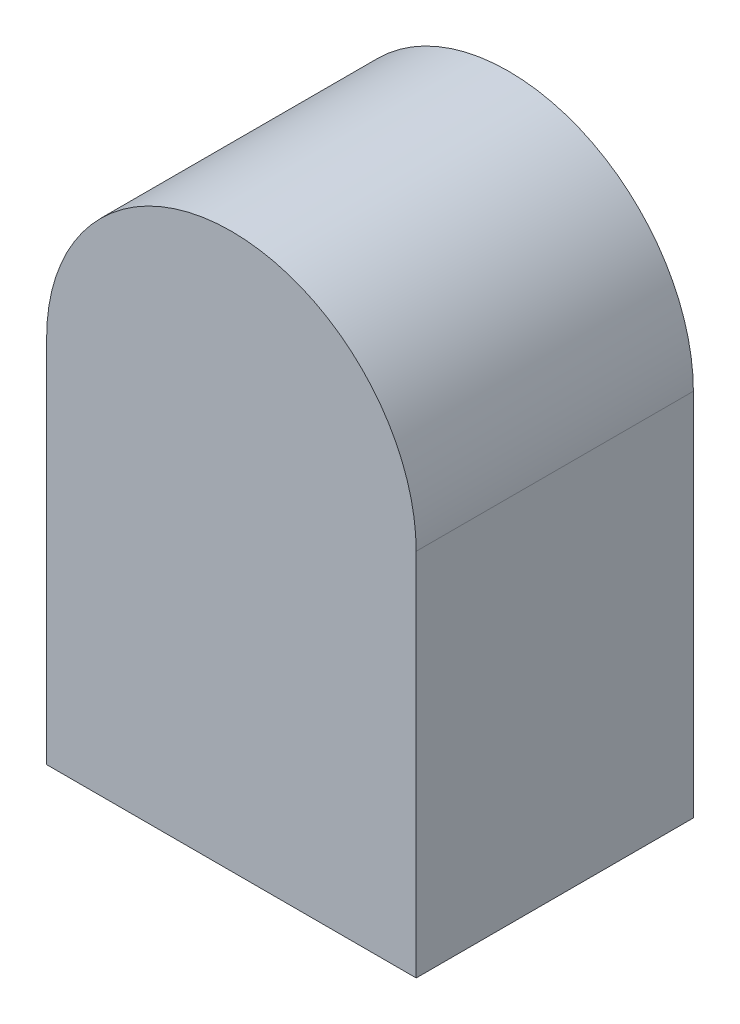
ISO-10303-21;
HEADER;
FILE_DESCRIPTION(('STEP AP214'),'2;1');
FILE_NAME('part.step','',(''),(''),'','','');
FILE_SCHEMA(('AUTOMOTIVE_DESIGN { 1 0 10303 214 1 1 1 1 }'));
ENDSEC;
DATA;
#1=APPLICATION_CONTEXT('core data for automotive mechanical design processes');
#2=APPLICATION_PROTOCOL_DEFINITION('international standard','automotive_design',2000,#1);
#3=PRODUCT_CONTEXT('',#1,'mechanical');
#4=PRODUCT('Part','Part','',(#3));
#5=PRODUCT_RELATED_PRODUCT_CATEGORY('part','',(#4));
#6=PRODUCT_DEFINITION_FORMATION('','',#4);
#7=PRODUCT_DEFINITION_CONTEXT('part definition',#1,'design');
#8=PRODUCT_DEFINITION('design','',#6,#7);
#9=PRODUCT_DEFINITION_SHAPE('','',#8);
#10=(LENGTH_UNIT() NAMED_UNIT(*) SI_UNIT(.MILLI.,.METRE.));
#11=(NAMED_UNIT(*) PLANE_ANGLE_UNIT() SI_UNIT($,.RADIAN.));
#12=(NAMED_UNIT(*) SI_UNIT($,.STERADIAN.) SOLID_ANGLE_UNIT());
#13=UNCERTAINTY_MEASURE_WITH_UNIT(LENGTH_MEASURE(1.E-05),#10,'distance_accuracy_value','');
#14=(GEOMETRIC_REPRESENTATION_CONTEXT(3) GLOBAL_UNCERTAINTY_ASSIGNED_CONTEXT((#13)) GLOBAL_UNIT_ASSIGNED_CONTEXT((#10,
#11,#12)) REPRESENTATION_CONTEXT('',''));
#15=CARTESIAN_POINT('',(0.,0.,0.));
#16=DIRECTION('',(0.,0.,1.));
#17=DIRECTION('',(1.,0.,0.));
#18=AXIS2_PLACEMENT_3D('',#15,#16,#17);
#19=CARTESIAN_POINT('',(25.4,0.,-38.1));
#20=DIRECTION('',(0.,-1.,0.));
#21=DIRECTION('',(1.,0.,0.));
#22=AXIS2_PLACEMENT_3D('',#19,#20,#21);
#23=PLANE('',#22);
#24=DIRECTION('',(1.,0.,0.));
#25=VECTOR('',#24,1.);
#26=CARTESIAN_POINT('',(25.4,0.,0.));
#27=LINE('',#26,#25);
#28=CARTESIAN_POINT('',(-25.4,0.,0.));
#29=VERTEX_POINT('',#28);
#30=CARTESIAN_POINT('',(25.4,0.,0.));
#31=VERTEX_POINT('',#30);
#32=EDGE_CURVE('E94',#29,#31,#27,.T.);
#33=ORIENTED_EDGE('',*,*,#32,.F.);
#34=DIRECTION('',(0.,0.,1.));
#35=VECTOR('',#34,1.);
#36=CARTESIAN_POINT('',(-25.4,0.,-38.1));
#37=LINE('',#36,#35);
#38=CARTESIAN_POINT('',(-25.4,0.,-38.1));
#39=VERTEX_POINT('',#38);
#40=EDGE_CURVE('E11',#39,#29,#37,.T.);
#41=ORIENTED_EDGE('',*,*,#40,.F.);
#42=DIRECTION('',(1.,0.,0.));
#43=VECTOR('',#42,1.);
#44=CARTESIAN_POINT('',(25.4,0.,-38.1));
#45=LINE('',#44,#43);
#46=CARTESIAN_POINT('',(25.4,0.,-38.1));
#47=VERTEX_POINT('',#46);
#48=EDGE_CURVE('E88',#39,#47,#45,.T.);
#49=ORIENTED_EDGE('',*,*,#48,.T.);
#50=DIRECTION('',(0.,0.,1.));
#51=VECTOR('',#50,1.);
#52=CARTESIAN_POINT('',(25.4,0.,-38.1));
#53=LINE('',#52,#51);
#54=EDGE_CURVE('E33',#47,#31,#53,.T.);
#55=ORIENTED_EDGE('',*,*,#54,.T.);
#56=EDGE_LOOP('',(#33,#41,#49,#55));
#57=FACE_BOUND('',#56,.T.);
#58=ADVANCED_FACE('F30',(#57),#23,.T.);
#59=CARTESIAN_POINT('',(-25.4,0.,-38.1));
#60=DIRECTION('',(-1.,0.,0.));
#61=DIRECTION('',(0.,-1.,0.));
#62=AXIS2_PLACEMENT_3D('',#59,#60,#61);
#63=PLANE('',#62);
#64=DIRECTION('',(0.,-1.,0.));
#65=VECTOR('',#64,1.);
#66=CARTESIAN_POINT('',(-25.4,0.,0.));
#67=LINE('',#66,#65);
#68=CARTESIAN_POINT('',(-25.4,50.8,0.));
#69=VERTEX_POINT('',#68);
#70=EDGE_CURVE('E90',#69,#29,#67,.T.);
#71=ORIENTED_EDGE('',*,*,#70,.F.);
#72=DIRECTION('',(0.,0.,1.));
#73=VECTOR('',#72,1.);
#74=CARTESIAN_POINT('',(-25.4,50.8,-38.1));
#75=LINE('',#74,#73);
#76=CARTESIAN_POINT('',(-25.4,50.8,-38.1));
#77=VERTEX_POINT('',#76);
#78=EDGE_CURVE('E39',#77,#69,#75,.T.);
#79=ORIENTED_EDGE('',*,*,#78,.F.);
#80=DIRECTION('',(0.,-1.,0.));
#81=VECTOR('',#80,1.);
#82=CARTESIAN_POINT('',(-25.4,0.,-38.1));
#83=LINE('',#82,#81);
#84=EDGE_CURVE('E85',#77,#39,#83,.T.);
#85=ORIENTED_EDGE('',*,*,#84,.T.);
#86=ORIENTED_EDGE('',*,*,#40,.T.);
#87=EDGE_LOOP('',(#71,#79,#85,#86));
#88=FACE_BOUND('',#87,.T.);
#89=ADVANCED_FACE('F104',(#88),#63,.T.);
#90=CARTESIAN_POINT('',(0.,50.8,-38.1));
#91=DIRECTION('',(0.,0.,1.));
#92=DIRECTION('',(1.,0.,0.));
#93=AXIS2_PLACEMENT_3D('',#90,#91,#92);
#94=CYLINDRICAL_SURFACE('',#93,25.4);
#95=CARTESIAN_POINT('',(0.,50.8,0.));
#96=DIRECTION('',(0.,0.,1.));
#97=DIRECTION('',(-1.,0.,0.));
#98=AXIS2_PLACEMENT_3D('',#95,#96,#97);
#99=CIRCLE('',#98,25.4);
#100=CARTESIAN_POINT('',(25.4,50.8,0.));
#101=VERTEX_POINT('',#100);
#102=EDGE_CURVE('E80',#101,#69,#99,.T.);
#103=ORIENTED_EDGE('',*,*,#102,.F.);
#104=DIRECTION('',(0.,0.,1.));
#105=VECTOR('',#104,1.);
#106=CARTESIAN_POINT('',(25.4,50.8,-38.1));
#107=LINE('',#106,#105);
#108=CARTESIAN_POINT('',(25.4,50.8,-38.1));
#109=VERTEX_POINT('',#108);
#110=EDGE_CURVE('E75',#109,#101,#107,.T.);
#111=ORIENTED_EDGE('',*,*,#110,.F.);
#112=CARTESIAN_POINT('',(0.,50.8,-38.1));
#113=DIRECTION('',(0.,0.,1.));
#114=DIRECTION('',(-1.,0.,0.));
#115=AXIS2_PLACEMENT_3D('',#112,#113,#114);
#116=CIRCLE('',#115,25.4);
#117=EDGE_CURVE('E78',#109,#77,#116,.T.);
#118=ORIENTED_EDGE('',*,*,#117,.T.);
#119=ORIENTED_EDGE('',*,*,#78,.T.);
#120=EDGE_LOOP('',(#103,#111,#118,#119));
#121=FACE_BOUND('',#120,.T.);
#122=ADVANCED_FACE('F77',(#121),#94,.T.);
#123=CARTESIAN_POINT('',(25.4,50.8,-38.1));
#124=DIRECTION('',(1.,0.,0.));
#125=DIRECTION('',(0.,1.,0.));
#126=AXIS2_PLACEMENT_3D('',#123,#124,#125);
#127=PLANE('',#126);
#128=DIRECTION('',(0.,1.,0.));
#129=VECTOR('',#128,1.);
#130=CARTESIAN_POINT('',(25.4,50.8,0.));
#131=LINE('',#130,#129);
#132=EDGE_CURVE('E97',#31,#101,#131,.T.);
#133=ORIENTED_EDGE('',*,*,#132,.F.);
#134=ORIENTED_EDGE('',*,*,#54,.F.);
#135=DIRECTION('',(0.,1.,0.));
#136=VECTOR('',#135,1.);
#137=CARTESIAN_POINT('',(25.4,50.8,-38.1));
#138=LINE('',#137,#136);
#139=EDGE_CURVE('E84',#47,#109,#138,.T.);
#140=ORIENTED_EDGE('',*,*,#139,.T.);
#141=ORIENTED_EDGE('',*,*,#110,.T.);
#142=EDGE_LOOP('',(#133,#134,#140,#141));
#143=FACE_BOUND('',#142,.T.);
#144=ADVANCED_FACE('F87',(#143),#127,.T.);
#145=CARTESIAN_POINT('',(0.,50.8,-38.1));
#146=DIRECTION('',(0.,0.,-1.));
#147=DIRECTION('',(-1.,0.,0.));
#148=AXIS2_PLACEMENT_3D('',#145,#146,#147);
#149=PLANE('',#148);
#150=ORIENTED_EDGE('',*,*,#48,.F.);
#151=ORIENTED_EDGE('',*,*,#84,.F.);
#152=ORIENTED_EDGE('',*,*,#117,.F.);
#153=ORIENTED_EDGE('',*,*,#139,.F.);
#154=EDGE_LOOP('',(#150,#151,#152,#153));
#155=FACE_BOUND('',#154,.T.);
#156=ADVANCED_FACE('F83',(#155),#149,.T.);
#157=CARTESIAN_POINT('',(0.,50.8,0.));
#158=DIRECTION('',(0.,0.,-1.));
#159=DIRECTION('',(-1.,0.,0.));
#160=AXIS2_PLACEMENT_3D('',#157,#158,#159);
#161=PLANE('',#160);
#162=ORIENTED_EDGE('',*,*,#32,.T.);
#163=ORIENTED_EDGE('',*,*,#132,.T.);
#164=ORIENTED_EDGE('',*,*,#102,.T.);
#165=ORIENTED_EDGE('',*,*,#70,.T.);
#166=EDGE_LOOP('',(#162,#163,#164,#165));
#167=FACE_BOUND('',#166,.T.);
#168=ADVANCED_FACE('F103',(#167),#161,.F.);
#169=CLOSED_SHELL('',(#58,#89,#122,#144,#156,#168));
#170=MANIFOLD_SOLID_BREP('B2',#169);
#171=ADVANCED_BREP_SHAPE_REPRESENTATION('',(#18,#170),#14);
#172=SHAPE_DEFINITION_REPRESENTATION(#9,#171);
ENDSEC;
END-ISO-10303-21;
